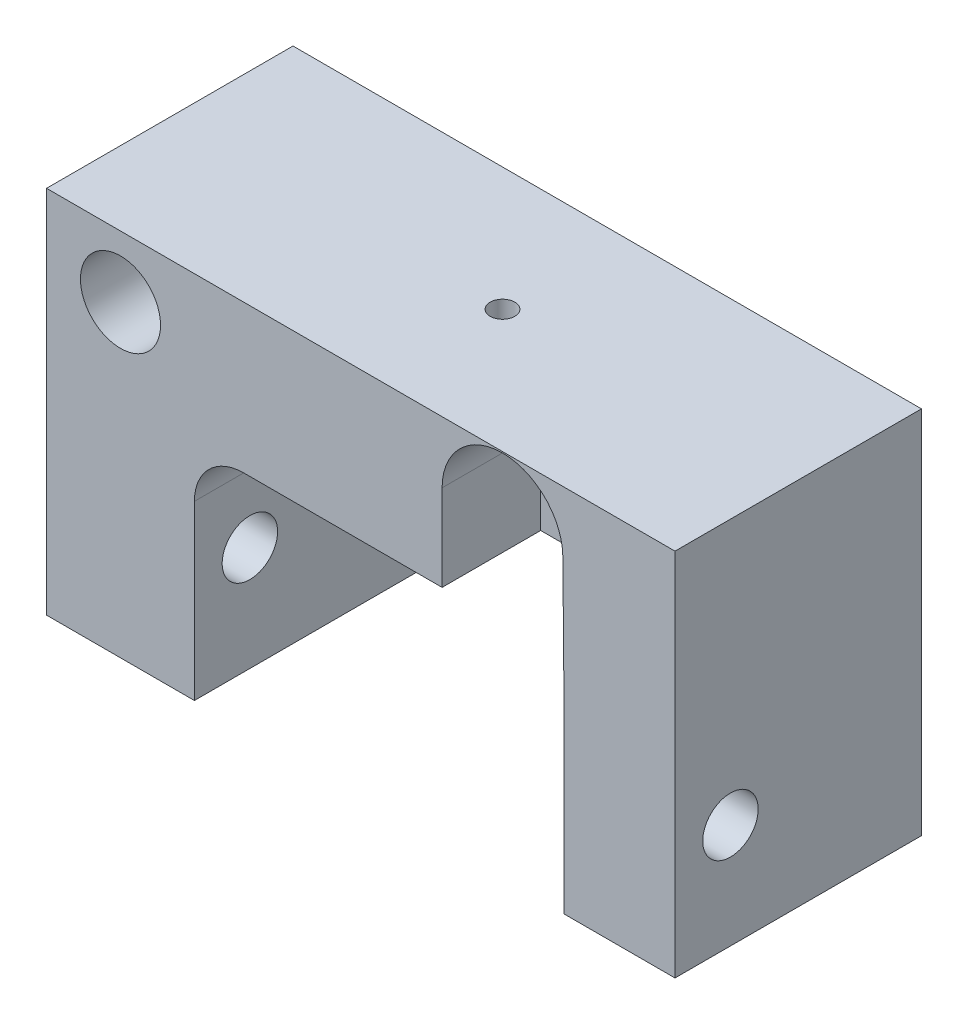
ISO-10303-21;
HEADER;
FILE_DESCRIPTION(('STEP AP214'),'2;1');
FILE_NAME('part.step','',(''),(''),'','','');
FILE_SCHEMA(('AUTOMOTIVE_DESIGN { 1 0 10303 214 1 1 1 1 }'));
ENDSEC;
DATA;
#1=APPLICATION_CONTEXT('core data for automotive mechanical design processes');
#2=APPLICATION_PROTOCOL_DEFINITION('international standard','automotive_design',2000,#1);
#3=PRODUCT_CONTEXT('',#1,'mechanical');
#4=PRODUCT('Part','Part','',(#3));
#5=PRODUCT_RELATED_PRODUCT_CATEGORY('part','',(#4));
#6=PRODUCT_DEFINITION_FORMATION('','',#4);
#7=PRODUCT_DEFINITION_CONTEXT('part definition',#1,'design');
#8=PRODUCT_DEFINITION('design','',#6,#7);
#9=PRODUCT_DEFINITION_SHAPE('','',#8);
#10=(LENGTH_UNIT() NAMED_UNIT(*) SI_UNIT(.MILLI.,.METRE.));
#11=(NAMED_UNIT(*) PLANE_ANGLE_UNIT() SI_UNIT($,.RADIAN.));
#12=(NAMED_UNIT(*) SI_UNIT($,.STERADIAN.) SOLID_ANGLE_UNIT());
#13=UNCERTAINTY_MEASURE_WITH_UNIT(LENGTH_MEASURE(1.E-05),#10,'distance_accuracy_value','');
#14=(GEOMETRIC_REPRESENTATION_CONTEXT(3) GLOBAL_UNCERTAINTY_ASSIGNED_CONTEXT((#13)) GLOBAL_UNIT_ASSIGNED_CONTEXT((#10,
#11,#12)) REPRESENTATION_CONTEXT('',''));
#15=CARTESIAN_POINT('',(0.,0.,0.));
#16=DIRECTION('',(0.,0.,1.));
#17=DIRECTION('',(1.,0.,0.));
#18=AXIS2_PLACEMENT_3D('',#15,#16,#17);
#19=CARTESIAN_POINT('',(11.5,10.,20.));
#20=DIRECTION('',(0.,0.,-1.));
#21=DIRECTION('',(-1.,0.,0.));
#22=AXIS2_PLACEMENT_3D('',#19,#20,#21);
#23=CYLINDRICAL_SURFACE('',#22,1.6);
#24=CARTESIAN_POINT('',(11.5,10.,0.));
#25=DIRECTION('',(0.,0.,-1.));
#26=DIRECTION('',(-1.,0.,0.));
#27=AXIS2_PLACEMENT_3D('',#24,#25,#26);
#28=CIRCLE('',#27,1.6);
#29=CARTESIAN_POINT('',(9.89999999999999,10.,0.));
#30=VERTEX_POINT('',#29);
#31=EDGE_CURVE('E213',#30,#30,#28,.T.);
#32=ORIENTED_EDGE('',*,*,#31,.T.);
#33=EDGE_LOOP('',(#32));
#34=FACE_BOUND('',#33,.T.);
#35=CARTESIAN_POINT('',(11.5,10.,12.));
#36=DIRECTION('',(0.,0.,1.));
#37=DIRECTION('',(1.,0.,0.));
#38=AXIS2_PLACEMENT_3D('',#35,#36,#37);
#39=CIRCLE('',#38,1.6);
#40=CARTESIAN_POINT('',(13.1,10.,12.));
#41=VERTEX_POINT('',#40);
#42=EDGE_CURVE('E38',#41,#41,#39,.F.);
#43=ORIENTED_EDGE('',*,*,#42,.F.);
#44=EDGE_LOOP('',(#43));
#45=FACE_BOUND('',#44,.T.);
#46=ADVANCED_FACE('F34',(#34,#45),#23,.F.);
#47=CARTESIAN_POINT('',(-19.5,10.,20.));
#48=DIRECTION('',(0.,0.,-1.));
#49=DIRECTION('',(-1.,0.,0.));
#50=AXIS2_PLACEMENT_3D('',#47,#48,#49);
#51=CYLINDRICAL_SURFACE('',#50,1.6);
#52=CARTESIAN_POINT('',(-19.5,10.,0.));
#53=DIRECTION('',(0.,0.,-1.));
#54=DIRECTION('',(-1.,0.,0.));
#55=AXIS2_PLACEMENT_3D('',#52,#53,#54);
#56=CIRCLE('',#55,1.6);
#57=CARTESIAN_POINT('',(-21.1,10.,0.));
#58=VERTEX_POINT('',#57);
#59=EDGE_CURVE('E210',#58,#58,#56,.T.);
#60=ORIENTED_EDGE('',*,*,#59,.T.);
#61=EDGE_LOOP('',(#60));
#62=FACE_BOUND('',#61,.T.);
#63=CARTESIAN_POINT('',(-19.5,10.,14.));
#64=DIRECTION('',(0.,0.,1.));
#65=DIRECTION('',(1.,0.,0.));
#66=AXIS2_PLACEMENT_3D('',#63,#64,#65);
#67=CIRCLE('',#66,1.6);
#68=CARTESIAN_POINT('',(-17.9,10.,14.));
#69=VERTEX_POINT('',#68);
#70=EDGE_CURVE('E193',#69,#69,#67,.F.);
#71=ORIENTED_EDGE('',*,*,#70,.F.);
#72=EDGE_LOOP('',(#71));
#73=FACE_BOUND('',#72,.T.);
#74=ADVANCED_FACE('F356',(#62,#73),#51,.F.);
#75=CARTESIAN_POINT('',(-9.50000000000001,-0.999999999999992,20.));
#76=DIRECTION('',(0.,0.,-1.));
#77=DIRECTION('',(-1.,0.,0.));
#78=AXIS2_PLACEMENT_3D('',#75,#76,#77);
#79=CYLINDRICAL_SURFACE('',#78,4.);
#80=CARTESIAN_POINT('',(-9.50000000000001,-0.999999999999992,2.2));
#81=DIRECTION('',(0.,0.,-1.));
#82=DIRECTION('',(-1.,0.,0.));
#83=AXIS2_PLACEMENT_3D('',#80,#81,#82);
#84=CIRCLE('',#83,4.);
#85=CARTESIAN_POINT('',(-13.5,-0.999999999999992,2.2));
#86=VERTEX_POINT('',#85);
#87=CARTESIAN_POINT('',(-12.4005171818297,1.75445095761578,2.2));
#88=VERTEX_POINT('',#87);
#89=EDGE_CURVE('E207',#86,#88,#84,.T.);
#90=ORIENTED_EDGE('',*,*,#89,.T.);
#91=CARTESIAN_POINT('',(-9.49999999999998,3.00000000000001,2.2));
#92=VERTEX_POINT('',#91);
#93=EDGE_CURVE('E204',#88,#92,#84,.T.);
#94=ORIENTED_EDGE('',*,*,#93,.T.);
#95=DIRECTION('',(0.,0.,-1.));
#96=VECTOR('',#95,1.);
#97=CARTESIAN_POINT('',(-9.49999999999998,3.00000000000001,20.));
#98=LINE('',#97,#96);
#99=CARTESIAN_POINT('',(-9.49999999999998,3.00000000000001,20.));
#100=VERTEX_POINT('',#99);
#101=EDGE_CURVE('E296',#100,#92,#98,.T.);
#102=ORIENTED_EDGE('',*,*,#101,.F.);
#103=CARTESIAN_POINT('',(-9.50000000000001,-0.999999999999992,20.));
#104=DIRECTION('',(0.,0.,1.));
#105=DIRECTION('',(1.,0.,0.));
#106=AXIS2_PLACEMENT_3D('',#103,#104,#105);
#107=CIRCLE('',#106,4.);
#108=CARTESIAN_POINT('',(-13.5,-1.00000000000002,20.));
#109=VERTEX_POINT('',#108);
#110=EDGE_CURVE('E256',#100,#109,#107,.T.);
#111=ORIENTED_EDGE('',*,*,#110,.T.);
#112=DIRECTION('',(0.,0.,-1.));
#113=VECTOR('',#112,1.);
#114=CARTESIAN_POINT('',(-13.5,-1.00000000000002,20.));
#115=LINE('',#114,#113);
#116=EDGE_CURVE('E293',#109,#86,#115,.T.);
#117=ORIENTED_EDGE('',*,*,#116,.T.);
#118=EDGE_LOOP('',(#90,#94,#102,#111,#117));
#119=FACE_BOUND('',#118,.T.);
#120=ADVANCED_FACE('F323',(#119),#79,.F.);
#121=CARTESIAN_POINT('',(-25.5,-15.,20.));
#122=DIRECTION('',(-1.,0.,0.));
#123=DIRECTION('',(0.,0.,1.));
#124=AXIS2_PLACEMENT_3D('',#121,#122,#123);
#125=PLANE('',#124);
#126=CARTESIAN_POINT('',(-25.5,-6.5,15.5));
#127=DIRECTION('',(1.,0.,0.));
#128=DIRECTION('',(0.,0.,-1.));
#129=AXIS2_PLACEMENT_3D('',#126,#127,#128);
#130=CIRCLE('',#129,2.25);
#131=CARTESIAN_POINT('',(-25.5,-6.5,13.25));
#132=VERTEX_POINT('',#131);
#133=EDGE_CURVE('E217',#132,#132,#130,.T.);
#134=ORIENTED_EDGE('',*,*,#133,.T.);
#135=EDGE_LOOP('',(#134));
#136=FACE_BOUND('',#135,.T.);
#137=DIRECTION('',(0.,1.,0.));
#138=VECTOR('',#137,1.);
#139=CARTESIAN_POINT('',(-25.5,-15.,0.));
#140=LINE('',#139,#138);
#141=CARTESIAN_POINT('',(-25.5,-15.,0.));
#142=VERTEX_POINT('',#141);
#143=CARTESIAN_POINT('',(-25.5,15.,0.));
#144=VERTEX_POINT('',#143);
#145=EDGE_CURVE('E234',#142,#144,#140,.T.);
#146=ORIENTED_EDGE('',*,*,#145,.F.);
#147=DIRECTION('',(0.,0.,-1.));
#148=VECTOR('',#147,1.);
#149=CARTESIAN_POINT('',(-25.5,-15.,20.));
#150=LINE('',#149,#148);
#151=CARTESIAN_POINT('',(-25.5,-15.,20.));
#152=VERTEX_POINT('',#151);
#153=EDGE_CURVE('E288',#152,#142,#150,.T.);
#154=ORIENTED_EDGE('',*,*,#153,.F.);
#155=DIRECTION('',(0.,1.,0.));
#156=VECTOR('',#155,1.);
#157=CARTESIAN_POINT('',(-25.5,-15.,20.));
#158=LINE('',#157,#156);
#159=CARTESIAN_POINT('',(-25.5,15.,20.));
#160=VERTEX_POINT('',#159);
#161=EDGE_CURVE('E235',#152,#160,#158,.T.);
#162=ORIENTED_EDGE('',*,*,#161,.T.);
#163=DIRECTION('',(0.,0.,-1.));
#164=VECTOR('',#163,1.);
#165=CARTESIAN_POINT('',(-25.5,15.,20.));
#166=LINE('',#165,#164);
#167=EDGE_CURVE('E263',#160,#144,#166,.T.);
#168=ORIENTED_EDGE('',*,*,#167,.T.);
#169=EDGE_LOOP('',(#146,#154,#162,#168));
#170=FACE_BOUND('',#169,.T.);
#171=ADVANCED_FACE('F36',(#136,#170),#125,.T.);
#172=CARTESIAN_POINT('',(-25.5,-15.,20.));
#173=DIRECTION('',(0.,1.,0.));
#174=DIRECTION('',(0.,0.,1.));
#175=AXIS2_PLACEMENT_3D('',#172,#173,#174);
#176=PLANE('',#175);
#177=DIRECTION('',(1.,0.,0.));
#178=VECTOR('',#177,1.);
#179=CARTESIAN_POINT('',(-25.5,-15.,0.));
#180=LINE('',#179,#178);
#181=CARTESIAN_POINT('',(-13.5,-15.,0.));
#182=VERTEX_POINT('',#181);
#183=EDGE_CURVE('E239',#142,#182,#180,.T.);
#184=ORIENTED_EDGE('',*,*,#183,.T.);
#185=DIRECTION('',(0.,0.,-1.));
#186=VECTOR('',#185,1.);
#187=CARTESIAN_POINT('',(-13.5,-15.,20.));
#188=LINE('',#187,#186);
#189=CARTESIAN_POINT('',(-13.5,-15.,20.));
#190=VERTEX_POINT('',#189);
#191=EDGE_CURVE('E290',#190,#182,#188,.T.);
#192=ORIENTED_EDGE('',*,*,#191,.F.);
#193=DIRECTION('',(1.,0.,0.));
#194=VECTOR('',#193,1.);
#195=CARTESIAN_POINT('',(-25.5,-15.,20.));
#196=LINE('',#195,#194);
#197=EDGE_CURVE('E261',#152,#190,#196,.T.);
#198=ORIENTED_EDGE('',*,*,#197,.F.);
#199=ORIENTED_EDGE('',*,*,#153,.T.);
#200=EDGE_LOOP('',(#184,#192,#198,#199));
#201=FACE_BOUND('',#200,.T.);
#202=ADVANCED_FACE('F382',(#201),#176,.F.);
#203=CARTESIAN_POINT('',(-13.5,-15.,20.));
#204=DIRECTION('',(-1.,0.,0.));
#205=DIRECTION('',(0.,0.,1.));
#206=AXIS2_PLACEMENT_3D('',#203,#204,#205);
#207=PLANE('',#206);
#208=CARTESIAN_POINT('',(-13.5,-6.5,15.5));
#209=DIRECTION('',(-1.,0.,0.));
#210=DIRECTION('',(0.,0.,1.));
#211=AXIS2_PLACEMENT_3D('',#208,#209,#210);
#212=CIRCLE('',#211,2.25);
#213=CARTESIAN_POINT('',(-13.5,-6.5,17.75));
#214=VERTEX_POINT('',#213);
#215=EDGE_CURVE('E225',#214,#214,#212,.T.);
#216=ORIENTED_EDGE('',*,*,#215,.T.);
#217=EDGE_LOOP('',(#216));
#218=FACE_BOUND('',#217,.T.);
#219=DIRECTION('',(0.,1.,0.));
#220=VECTOR('',#219,1.);
#221=CARTESIAN_POINT('',(-13.5,-15.,0.));
#222=LINE('',#221,#220);
#223=CARTESIAN_POINT('',(-13.5,-13.948107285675,0.));
#224=VERTEX_POINT('',#223);
#225=EDGE_CURVE('E284',#182,#224,#222,.T.);
#226=ORIENTED_EDGE('',*,*,#225,.T.);
#227=DIRECTION('',(0.,0.,-1.));
#228=VECTOR('',#227,1.);
#229=CARTESIAN_POINT('',(-13.5,-13.948107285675,2.2));
#230=LINE('',#229,#228);
#231=CARTESIAN_POINT('',(-13.5,-13.948107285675,2.2));
#232=VERTEX_POINT('',#231);
#233=EDGE_CURVE('E59',#224,#232,#230,.F.);
#234=ORIENTED_EDGE('',*,*,#233,.T.);
#235=DIRECTION('',(0.,-1.,0.));
#236=VECTOR('',#235,1.);
#237=CARTESIAN_POINT('',(-13.5,-15.,2.2));
#238=LINE('',#237,#236);
#239=EDGE_CURVE('E208',#86,#232,#238,.T.);
#240=ORIENTED_EDGE('',*,*,#239,.F.);
#241=ORIENTED_EDGE('',*,*,#116,.F.);
#242=DIRECTION('',(0.,1.,0.));
#243=VECTOR('',#242,1.);
#244=CARTESIAN_POINT('',(-13.5,-15.,20.));
#245=LINE('',#244,#243);
#246=EDGE_CURVE('E259',#190,#109,#245,.T.);
#247=ORIENTED_EDGE('',*,*,#246,.F.);
#248=ORIENTED_EDGE('',*,*,#191,.T.);
#249=EDGE_LOOP('',(#226,#234,#240,#241,#247,#248));
#250=FACE_BOUND('',#249,.T.);
#251=ADVANCED_FACE('F328',(#218,#250),#207,.F.);
#252=CARTESIAN_POINT('',(-9.49999999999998,3.00000000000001,20.));
#253=DIRECTION('',(0.,1.,0.));
#254=DIRECTION('',(0.,0.,1.));
#255=AXIS2_PLACEMENT_3D('',#252,#253,#254);
#256=PLANE('',#255);
#257=CARTESIAN_POINT('',(1.49999999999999,3.00000000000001,10.));
#258=DIRECTION('',(0.,1.,0.));
#259=DIRECTION('',(0.,0.,1.));
#260=AXIS2_PLACEMENT_3D('',#257,#258,#259);
#261=CIRCLE('',#260,1.);
#262=CARTESIAN_POINT('',(1.49999999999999,3.00000000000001,11.));
#263=VERTEX_POINT('',#262);
#264=EDGE_CURVE('E231',#263,#263,#261,.F.);
#265=ORIENTED_EDGE('',*,*,#264,.F.);
#266=EDGE_LOOP('',(#265));
#267=FACE_BOUND('',#266,.T.);
#268=DIRECTION('',(1.,0.,0.));
#269=VECTOR('',#268,1.);
#270=CARTESIAN_POINT('',(-9.49999999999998,3.00000000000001,12.));
#271=LINE('',#270,#269);
#272=CARTESIAN_POINT('',(6.59999999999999,3.00000000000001,12.));
#273=VERTEX_POINT('',#272);
#274=CARTESIAN_POINT('',(12.5,3.00000000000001,12.));
#275=VERTEX_POINT('',#274);
#276=EDGE_CURVE('E184',#273,#275,#271,.T.);
#277=ORIENTED_EDGE('',*,*,#276,.F.);
#278=DIRECTION('',(0.,0.,1.));
#279=VECTOR('',#278,1.);
#280=CARTESIAN_POINT('',(6.59999999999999,3.00000000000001,20.));
#281=LINE('',#280,#279);
#282=CARTESIAN_POINT('',(6.59999999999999,3.00000000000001,20.));
#283=VERTEX_POINT('',#282);
#284=EDGE_CURVE('E165',#273,#283,#281,.T.);
#285=ORIENTED_EDGE('',*,*,#284,.T.);
#286=DIRECTION('',(1.,0.,0.));
#287=VECTOR('',#286,1.);
#288=CARTESIAN_POINT('',(-9.49999999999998,3.00000000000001,20.));
#289=LINE('',#288,#287);
#290=EDGE_CURVE('E253',#100,#283,#289,.T.);
#291=ORIENTED_EDGE('',*,*,#290,.F.);
#292=ORIENTED_EDGE('',*,*,#101,.T.);
#293=DIRECTION('',(-1.,0.,0.));
#294=VECTOR('',#293,1.);
#295=CARTESIAN_POINT('',(-9.49999999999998,3.00000000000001,2.2));
#296=LINE('',#295,#294);
#297=CARTESIAN_POINT('',(4.16384461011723,3.00000000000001,2.2));
#298=VERTEX_POINT('',#297);
#299=EDGE_CURVE('E11',#298,#92,#296,.T.);
#300=ORIENTED_EDGE('',*,*,#299,.F.);
#301=DIRECTION('',(0.,0.,-1.));
#302=VECTOR('',#301,1.);
#303=CARTESIAN_POINT('',(4.16384461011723,3.00000000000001,2.2));
#304=LINE('',#303,#302);
#305=CARTESIAN_POINT('',(4.16384461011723,3.00000000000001,0.));
#306=VERTEX_POINT('',#305);
#307=EDGE_CURVE('E199',#298,#306,#304,.T.);
#308=ORIENTED_EDGE('',*,*,#307,.T.);
#309=DIRECTION('',(1.,0.,0.));
#310=VECTOR('',#309,1.);
#311=CARTESIAN_POINT('',(-9.49999999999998,3.00000000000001,0.));
#312=LINE('',#311,#310);
#313=CARTESIAN_POINT('',(12.5,3.00000000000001,0.));
#314=VERTEX_POINT('',#313);
#315=EDGE_CURVE('E281',#306,#314,#312,.T.);
#316=ORIENTED_EDGE('',*,*,#315,.T.);
#317=DIRECTION('',(0.,0.,-1.));
#318=VECTOR('',#317,1.);
#319=CARTESIAN_POINT('',(12.5,3.00000000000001,20.));
#320=LINE('',#319,#318);
#321=EDGE_CURVE('E299',#275,#314,#320,.T.);
#322=ORIENTED_EDGE('',*,*,#321,.F.);
#323=EDGE_LOOP('',(#277,#285,#291,#292,#300,#308,#316,#322));
#324=FACE_BOUND('',#323,.T.);
#325=ADVANCED_FACE('F337',(#267,#324),#256,.F.);
#326=CARTESIAN_POINT('',(12.5,-0.999999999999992,20.));
#327=DIRECTION('',(0.,0.,-1.));
#328=DIRECTION('',(-1.,0.,0.));
#329=AXIS2_PLACEMENT_3D('',#326,#327,#328);
#330=CYLINDRICAL_SURFACE('',#329,4.);
#331=DIRECTION('',(0.,0.,-1.));
#332=VECTOR('',#331,1.);
#333=CARTESIAN_POINT('',(16.499341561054,-0.927425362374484,20.));
#334=LINE('',#333,#332);
#335=CARTESIAN_POINT('',(16.499341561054,-0.927425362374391,12.));
#336=VERTEX_POINT('',#335);
#337=CARTESIAN_POINT('',(16.4993415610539,-0.927425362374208,20.));
#338=VERTEX_POINT('',#337);
#339=EDGE_CURVE('E187',#336,#338,#334,.F.);
#340=ORIENTED_EDGE('',*,*,#339,.F.);
#341=CARTESIAN_POINT('',(12.5,-0.999999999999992,12.));
#342=DIRECTION('',(0.,0.,1.));
#343=DIRECTION('',(1.,0.,0.));
#344=AXIS2_PLACEMENT_3D('',#341,#342,#343);
#345=CIRCLE('',#344,4.);
#346=EDGE_CURVE('E181',#336,#275,#345,.T.);
#347=ORIENTED_EDGE('',*,*,#346,.T.);
#348=ORIENTED_EDGE('',*,*,#321,.T.);
#349=CARTESIAN_POINT('',(12.5,-0.999999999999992,0.));
#350=DIRECTION('',(0.,0.,1.));
#351=DIRECTION('',(1.,0.,0.));
#352=AXIS2_PLACEMENT_3D('',#349,#350,#351);
#353=CIRCLE('',#352,4.);
#354=CARTESIAN_POINT('',(16.5,-1.00000000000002,0.));
#355=VERTEX_POINT('',#354);
#356=EDGE_CURVE('E278',#355,#314,#353,.T.);
#357=ORIENTED_EDGE('',*,*,#356,.F.);
#358=DIRECTION('',(0.,0.,-1.));
#359=VECTOR('',#358,1.);
#360=CARTESIAN_POINT('',(16.5,-1.00000000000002,20.));
#361=LINE('',#360,#359);
#362=CARTESIAN_POINT('',(16.5,-1.00000000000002,20.));
#363=VERTEX_POINT('',#362);
#364=EDGE_CURVE('E301',#363,#355,#361,.T.);
#365=ORIENTED_EDGE('',*,*,#364,.F.);
#366=CARTESIAN_POINT('',(12.5,-0.999999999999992,20.));
#367=DIRECTION('',(0.,0.,1.));
#368=DIRECTION('',(1.,0.,0.));
#369=AXIS2_PLACEMENT_3D('',#366,#367,#368);
#370=CIRCLE('',#369,4.);
#371=EDGE_CURVE('E250',#363,#338,#370,.T.);
#372=ORIENTED_EDGE('',*,*,#371,.T.);
#373=EDGE_LOOP('',(#340,#347,#348,#357,#365,#372));
#374=FACE_BOUND('',#373,.T.);
#375=ADVANCED_FACE('F393',(#374),#330,.F.);
#376=CARTESIAN_POINT('',(16.5,-15.,20.));
#377=DIRECTION('',(-1.,0.,0.));
#378=DIRECTION('',(0.,0.,1.));
#379=AXIS2_PLACEMENT_3D('',#376,#377,#378);
#380=PLANE('',#379);
#381=CARTESIAN_POINT('',(16.5,-6.5,15.5));
#382=DIRECTION('',(-1.,0.,0.));
#383=DIRECTION('',(0.,0.,1.));
#384=AXIS2_PLACEMENT_3D('',#381,#382,#383);
#385=CIRCLE('',#384,2.25);
#386=CARTESIAN_POINT('',(16.5,-6.5,17.75));
#387=VERTEX_POINT('',#386);
#388=EDGE_CURVE('E220',#387,#387,#385,.T.);
#389=ORIENTED_EDGE('',*,*,#388,.F.);
#390=EDGE_LOOP('',(#389));
#391=FACE_BOUND('',#390,.T.);
#392=DIRECTION('',(0.,1.,0.));
#393=VECTOR('',#392,1.);
#394=CARTESIAN_POINT('',(16.5,-15.,0.));
#395=LINE('',#394,#393);
#396=CARTESIAN_POINT('',(16.5,-15.,0.));
#397=VERTEX_POINT('',#396);
#398=EDGE_CURVE('E275',#397,#355,#395,.T.);
#399=ORIENTED_EDGE('',*,*,#398,.F.);
#400=DIRECTION('',(0.,0.,-1.));
#401=VECTOR('',#400,1.);
#402=CARTESIAN_POINT('',(16.5,-15.,20.));
#403=LINE('',#402,#401);
#404=CARTESIAN_POINT('',(16.5,-15.,20.));
#405=VERTEX_POINT('',#404);
#406=EDGE_CURVE('E303',#405,#397,#403,.T.);
#407=ORIENTED_EDGE('',*,*,#406,.F.);
#408=DIRECTION('',(0.,1.,0.));
#409=VECTOR('',#408,1.);
#410=CARTESIAN_POINT('',(16.5,-15.,20.));
#411=LINE('',#410,#409);
#412=EDGE_CURVE('E247',#405,#363,#411,.T.);
#413=ORIENTED_EDGE('',*,*,#412,.T.);
#414=ORIENTED_EDGE('',*,*,#364,.T.);
#415=EDGE_LOOP('',(#399,#407,#413,#414));
#416=FACE_BOUND('',#415,.T.);
#417=ADVANCED_FACE('F397',(#391,#416),#380,.T.);
#418=CARTESIAN_POINT('',(25.5,-15.,20.));
#419=DIRECTION('',(0.,-1.,0.));
#420=DIRECTION('',(1.,0.,0.));
#421=AXIS2_PLACEMENT_3D('',#418,#419,#420);
#422=PLANE('',#421);
#423=DIRECTION('',(-1.,0.,0.));
#424=VECTOR('',#423,1.);
#425=CARTESIAN_POINT('',(25.5,-15.,0.));
#426=LINE('',#425,#424);
#427=CARTESIAN_POINT('',(25.5,-15.,0.));
#428=VERTEX_POINT('',#427);
#429=EDGE_CURVE('E272',#428,#397,#426,.T.);
#430=ORIENTED_EDGE('',*,*,#429,.F.);
#431=DIRECTION('',(0.,0.,-1.));
#432=VECTOR('',#431,1.);
#433=CARTESIAN_POINT('',(25.5,-15.,20.));
#434=LINE('',#433,#432);
#435=CARTESIAN_POINT('',(25.5,-15.,20.));
#436=VERTEX_POINT('',#435);
#437=EDGE_CURVE('E305',#436,#428,#434,.T.);
#438=ORIENTED_EDGE('',*,*,#437,.F.);
#439=DIRECTION('',(-1.,0.,0.));
#440=VECTOR('',#439,1.);
#441=CARTESIAN_POINT('',(25.5,-15.,20.));
#442=LINE('',#441,#440);
#443=EDGE_CURVE('E244',#436,#405,#442,.T.);
#444=ORIENTED_EDGE('',*,*,#443,.T.);
#445=ORIENTED_EDGE('',*,*,#406,.T.);
#446=EDGE_LOOP('',(#430,#438,#444,#445));
#447=FACE_BOUND('',#446,.T.);
#448=ADVANCED_FACE('F401',(#447),#422,.T.);
#449=CARTESIAN_POINT('',(25.5,-15.,20.));
#450=DIRECTION('',(-1.,0.,0.));
#451=DIRECTION('',(0.,0.,1.));
#452=AXIS2_PLACEMENT_3D('',#449,#450,#451);
#453=PLANE('',#452);
#454=CARTESIAN_POINT('',(25.5,-6.5,15.5));
#455=DIRECTION('',(1.,0.,0.));
#456=DIRECTION('',(0.,0.,-1.));
#457=AXIS2_PLACEMENT_3D('',#454,#455,#456);
#458=CIRCLE('',#457,2.25);
#459=CARTESIAN_POINT('',(25.5,-6.5,13.25));
#460=VERTEX_POINT('',#459);
#461=EDGE_CURVE('E216',#460,#460,#458,.T.);
#462=ORIENTED_EDGE('',*,*,#461,.F.);
#463=EDGE_LOOP('',(#462));
#464=FACE_BOUND('',#463,.T.);
#465=DIRECTION('',(0.,1.,0.));
#466=VECTOR('',#465,1.);
#467=CARTESIAN_POINT('',(25.5,-15.,0.));
#468=LINE('',#467,#466);
#469=CARTESIAN_POINT('',(25.5,15.,0.));
#470=VERTEX_POINT('',#469);
#471=EDGE_CURVE('E269',#428,#470,#468,.T.);
#472=ORIENTED_EDGE('',*,*,#471,.T.);
#473=DIRECTION('',(0.,0.,-1.));
#474=VECTOR('',#473,1.);
#475=CARTESIAN_POINT('',(25.5,15.,20.));
#476=LINE('',#475,#474);
#477=CARTESIAN_POINT('',(25.5,15.,20.));
#478=VERTEX_POINT('',#477);
#479=EDGE_CURVE('E307',#478,#470,#476,.T.);
#480=ORIENTED_EDGE('',*,*,#479,.F.);
#481=DIRECTION('',(0.,1.,0.));
#482=VECTOR('',#481,1.);
#483=CARTESIAN_POINT('',(25.5,-15.,20.));
#484=LINE('',#483,#482);
#485=EDGE_CURVE('E242',#436,#478,#484,.T.);
#486=ORIENTED_EDGE('',*,*,#485,.F.);
#487=ORIENTED_EDGE('',*,*,#437,.T.);
#488=EDGE_LOOP('',(#472,#480,#486,#487));
#489=FACE_BOUND('',#488,.T.);
#490=ADVANCED_FACE('F405',(#464,#489),#453,.F.);
#491=CARTESIAN_POINT('',(-25.5,15.,20.));
#492=DIRECTION('',(0.,1.,0.));
#493=DIRECTION('',(0.,0.,1.));
#494=AXIS2_PLACEMENT_3D('',#491,#492,#493);
#495=PLANE('',#494);
#496=CARTESIAN_POINT('',(1.49999999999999,15.,10.));
#497=DIRECTION('',(0.,1.,0.));
#498=DIRECTION('',(0.,0.,1.));
#499=AXIS2_PLACEMENT_3D('',#496,#497,#498);
#500=CIRCLE('',#499,1.);
#501=CARTESIAN_POINT('',(1.49999999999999,15.,11.));
#502=VERTEX_POINT('',#501);
#503=EDGE_CURVE('E228',#502,#502,#500,.T.);
#504=ORIENTED_EDGE('',*,*,#503,.F.);
#505=EDGE_LOOP('',(#504));
#506=FACE_BOUND('',#505,.T.);
#507=DIRECTION('',(1.,0.,0.));
#508=VECTOR('',#507,1.);
#509=CARTESIAN_POINT('',(-25.5,15.,0.));
#510=LINE('',#509,#508);
#511=EDGE_CURVE('E266',#144,#470,#510,.T.);
#512=ORIENTED_EDGE('',*,*,#511,.F.);
#513=ORIENTED_EDGE('',*,*,#167,.F.);
#514=DIRECTION('',(1.,0.,0.));
#515=VECTOR('',#514,1.);
#516=CARTESIAN_POINT('',(-25.5,15.,20.));
#517=LINE('',#516,#515);
#518=EDGE_CURVE('E238',#160,#478,#517,.T.);
#519=ORIENTED_EDGE('',*,*,#518,.T.);
#520=ORIENTED_EDGE('',*,*,#479,.T.);
#521=EDGE_LOOP('',(#512,#513,#519,#520));
#522=FACE_BOUND('',#521,.T.);
#523=ADVANCED_FACE('F377',(#506,#522),#495,.T.);
#524=CARTESIAN_POINT('',(12.5,-0.999999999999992,20.));
#525=DIRECTION('',(0.,0.,1.));
#526=DIRECTION('',(1.,0.,0.));
#527=AXIS2_PLACEMENT_3D('',#524,#525,#526);
#528=PLANE('',#527);
#529=DIRECTION('',(-0.00907220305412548,0.999958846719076,0.));
#530=VECTOR('',#529,1.);
#531=CARTESIAN_POINT('',(16.3997983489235,10.0444537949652,20.));
#532=LINE('',#531,#530);
#533=CARTESIAN_POINT('',(16.3997983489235,10.0444537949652,20.));
#534=VERTEX_POINT('',#533);
#535=EDGE_CURVE('E172',#338,#534,#532,.T.);
#536=ORIENTED_EDGE('',*,*,#535,.F.);
#537=ORIENTED_EDGE('',*,*,#371,.F.);
#538=ORIENTED_EDGE('',*,*,#412,.F.);
#539=ORIENTED_EDGE('',*,*,#443,.F.);
#540=ORIENTED_EDGE('',*,*,#485,.T.);
#541=ORIENTED_EDGE('',*,*,#518,.F.);
#542=ORIENTED_EDGE('',*,*,#161,.F.);
#543=ORIENTED_EDGE('',*,*,#197,.T.);
#544=ORIENTED_EDGE('',*,*,#246,.T.);
#545=ORIENTED_EDGE('',*,*,#110,.F.);
#546=ORIENTED_EDGE('',*,*,#290,.T.);
#547=DIRECTION('',(0.,-1.,0.));
#548=VECTOR('',#547,1.);
#549=CARTESIAN_POINT('',(6.59999999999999,-1.00000000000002,20.));
#550=LINE('',#549,#548);
#551=CARTESIAN_POINT('',(6.59999999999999,10.,20.));
#552=VERTEX_POINT('',#551);
#553=EDGE_CURVE('E174',#552,#283,#550,.T.);
#554=ORIENTED_EDGE('',*,*,#553,.F.);
#555=CARTESIAN_POINT('',(11.5,10.,20.));
#556=DIRECTION('',(0.,0.,1.));
#557=DIRECTION('',(1.,0.,0.));
#558=AXIS2_PLACEMENT_3D('',#555,#556,#557);
#559=CIRCLE('',#558,4.9);
#560=EDGE_CURVE('E51',#534,#552,#559,.T.);
#561=ORIENTED_EDGE('',*,*,#560,.F.);
#562=EDGE_LOOP('',(#536,#537,#538,#539,#540,#541,#542,#543,#544,#545,#546,#554,#561));
#563=FACE_BOUND('',#562,.T.);
#564=CARTESIAN_POINT('',(-19.5,10.,20.));
#565=DIRECTION('',(0.,0.,1.));
#566=DIRECTION('',(1.,0.,0.));
#567=AXIS2_PLACEMENT_3D('',#564,#565,#566);
#568=CIRCLE('',#567,3.25);
#569=CARTESIAN_POINT('',(-16.25,10.,20.));
#570=VERTEX_POINT('',#569);
#571=EDGE_CURVE('E189',#570,#570,#568,.T.);
#572=ORIENTED_EDGE('',*,*,#571,.F.);
#573=EDGE_LOOP('',(#572));
#574=FACE_BOUND('',#573,.T.);
#575=ADVANCED_FACE('F374',(#563,#574),#528,.T.);
#576=CARTESIAN_POINT('',(12.5,-0.999999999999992,0.));
#577=DIRECTION('',(0.,0.,1.));
#578=DIRECTION('',(1.,0.,0.));
#579=AXIS2_PLACEMENT_3D('',#576,#577,#578);
#580=PLANE('',#579);
#581=ORIENTED_EDGE('',*,*,#59,.F.);
#582=EDGE_LOOP('',(#581));
#583=FACE_BOUND('',#582,.T.);
#584=ORIENTED_EDGE('',*,*,#31,.F.);
#585=EDGE_LOOP('',(#584));
#586=FACE_BOUND('',#585,.T.);
#587=ORIENTED_EDGE('',*,*,#315,.F.);
#588=CARTESIAN_POINT('',(-3.43101450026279,-6.763359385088,0.));
#589=DIRECTION('',(0.,0.,1.));
#590=DIRECTION('',(1.,0.,0.));
#591=AXIS2_PLACEMENT_3D('',#588,#589,#590);
#592=CIRCLE('',#591,12.3695218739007);
#593=EDGE_CURVE('E43',#306,#224,#592,.T.);
#594=ORIENTED_EDGE('',*,*,#593,.T.);
#595=ORIENTED_EDGE('',*,*,#225,.F.);
#596=ORIENTED_EDGE('',*,*,#183,.F.);
#597=ORIENTED_EDGE('',*,*,#145,.T.);
#598=ORIENTED_EDGE('',*,*,#511,.T.);
#599=ORIENTED_EDGE('',*,*,#471,.F.);
#600=ORIENTED_EDGE('',*,*,#429,.T.);
#601=ORIENTED_EDGE('',*,*,#398,.T.);
#602=ORIENTED_EDGE('',*,*,#356,.T.);
#603=EDGE_LOOP('',(#587,#594,#595,#596,#597,#598,#599,#600,#601,#602));
#604=FACE_BOUND('',#603,.T.);
#605=ADVANCED_FACE('F334',(#583,#586,#604),#580,.F.);
#606=CARTESIAN_POINT('',(1.49999999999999,-15.001,10.));
#607=DIRECTION('',(0.,1.,0.));
#608=DIRECTION('',(0.,0.,1.));
#609=AXIS2_PLACEMENT_3D('',#606,#607,#608);
#610=CYLINDRICAL_SURFACE('',#609,1.);
#611=ORIENTED_EDGE('',*,*,#503,.T.);
#612=EDGE_LOOP('',(#611));
#613=FACE_BOUND('',#612,.T.);
#614=ORIENTED_EDGE('',*,*,#264,.T.);
#615=EDGE_LOOP('',(#614));
#616=FACE_BOUND('',#615,.T.);
#617=ADVANCED_FACE('F369',(#613,#616),#610,.F.);
#618=CARTESIAN_POINT('',(-25.5,-6.5,15.5));
#619=DIRECTION('',(1.,0.,0.));
#620=DIRECTION('',(0.,0.,-1.));
#621=AXIS2_PLACEMENT_3D('',#618,#619,#620);
#622=CYLINDRICAL_SURFACE('',#621,2.25);
#623=ORIENTED_EDGE('',*,*,#388,.T.);
#624=EDGE_LOOP('',(#623));
#625=FACE_BOUND('',#624,.T.);
#626=ORIENTED_EDGE('',*,*,#461,.T.);
#627=EDGE_LOOP('',(#626));
#628=FACE_BOUND('',#627,.T.);
#629=ADVANCED_FACE('F366',(#625,#628),#622,.F.);
#630=ORIENTED_EDGE('',*,*,#133,.F.);
#631=EDGE_LOOP('',(#630));
#632=FACE_BOUND('',#631,.T.);
#633=ORIENTED_EDGE('',*,*,#215,.F.);
#634=EDGE_LOOP('',(#633));
#635=FACE_BOUND('',#634,.T.);
#636=ADVANCED_FACE('F354',(#632,#635),#622,.F.);
#637=CARTESIAN_POINT('',(-3.43101450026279,-6.763359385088,2.2));
#638=DIRECTION('',(0.,0.,-1.));
#639=DIRECTION('',(-1.,0.,0.));
#640=AXIS2_PLACEMENT_3D('',#637,#638,#639);
#641=PLANE('',#640);
#642=ORIENTED_EDGE('',*,*,#239,.T.);
#643=CARTESIAN_POINT('',(-3.43101450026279,-6.763359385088,2.2));
#644=DIRECTION('',(0.,0.,-1.));
#645=DIRECTION('',(-1.,0.,0.));
#646=AXIS2_PLACEMENT_3D('',#643,#644,#645);
#647=CIRCLE('',#646,12.3695218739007);
#648=EDGE_CURVE('E200',#232,#88,#647,.T.);
#649=ORIENTED_EDGE('',*,*,#648,.T.);
#650=ORIENTED_EDGE('',*,*,#89,.F.);
#651=EDGE_LOOP('',(#642,#649,#650));
#652=FACE_BOUND('',#651,.T.);
#653=ADVANCED_FACE('F316',(#652),#641,.T.);
#654=CARTESIAN_POINT('',(-3.43101450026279,-6.763359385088,2.2));
#655=DIRECTION('',(0.,0.,-1.));
#656=DIRECTION('',(-1.,0.,0.));
#657=AXIS2_PLACEMENT_3D('',#654,#655,#656);
#658=CYLINDRICAL_SURFACE('',#657,12.3695218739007);
#659=ORIENTED_EDGE('',*,*,#593,.F.);
#660=ORIENTED_EDGE('',*,*,#307,.F.);
#661=EDGE_CURVE('E196',#88,#298,#647,.T.);
#662=ORIENTED_EDGE('',*,*,#661,.F.);
#663=ORIENTED_EDGE('',*,*,#648,.F.);
#664=ORIENTED_EDGE('',*,*,#233,.F.);
#665=EDGE_LOOP('',(#659,#660,#662,#663,#664));
#666=FACE_BOUND('',#665,.T.);
#667=ADVANCED_FACE('F319',(#666),#658,.F.);
#668=ORIENTED_EDGE('',*,*,#661,.T.);
#669=ORIENTED_EDGE('',*,*,#299,.T.);
#670=ORIENTED_EDGE('',*,*,#93,.F.);
#671=EDGE_LOOP('',(#668,#669,#670));
#672=FACE_BOUND('',#671,.T.);
#673=ADVANCED_FACE('F340',(#672),#641,.T.);
#674=CARTESIAN_POINT('',(-19.5,10.,14.));
#675=DIRECTION('',(0.,0.,1.));
#676=DIRECTION('',(1.,0.,0.));
#677=AXIS2_PLACEMENT_3D('',#674,#675,#676);
#678=PLANE('',#677);
#679=CARTESIAN_POINT('',(-19.5,10.,14.));
#680=DIRECTION('',(0.,0.,1.));
#681=DIRECTION('',(1.,0.,0.));
#682=AXIS2_PLACEMENT_3D('',#679,#680,#681);
#683=CIRCLE('',#682,3.25);
#684=CARTESIAN_POINT('',(-16.25,10.,14.));
#685=VERTEX_POINT('',#684);
#686=EDGE_CURVE('E190',#685,#685,#683,.T.);
#687=ORIENTED_EDGE('',*,*,#686,.T.);
#688=EDGE_LOOP('',(#687));
#689=FACE_BOUND('',#688,.T.);
#690=ORIENTED_EDGE('',*,*,#70,.T.);
#691=EDGE_LOOP('',(#690));
#692=FACE_BOUND('',#691,.T.);
#693=ADVANCED_FACE('F342',(#689,#692),#678,.T.);
#694=CARTESIAN_POINT('',(-19.5,10.,14.));
#695=DIRECTION('',(0.,0.,1.));
#696=DIRECTION('',(1.,0.,0.));
#697=AXIS2_PLACEMENT_3D('',#694,#695,#696);
#698=CYLINDRICAL_SURFACE('',#697,3.25);
#699=ORIENTED_EDGE('',*,*,#686,.F.);
#700=EDGE_LOOP('',(#699));
#701=FACE_BOUND('',#700,.T.);
#702=ORIENTED_EDGE('',*,*,#571,.T.);
#703=EDGE_LOOP('',(#702));
#704=FACE_BOUND('',#703,.T.);
#705=ADVANCED_FACE('F348',(#701,#704),#698,.F.);
#706=CARTESIAN_POINT('',(6.59999999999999,-1.00000000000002,12.));
#707=DIRECTION('',(-1.,0.,0.));
#708=DIRECTION('',(0.,-1.,0.));
#709=AXIS2_PLACEMENT_3D('',#706,#707,#708);
#710=PLANE('',#709);
#711=DIRECTION('',(0.,-1.,0.));
#712=VECTOR('',#711,1.);
#713=CARTESIAN_POINT('',(6.59999999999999,-1.00000000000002,12.));
#714=LINE('',#713,#712);
#715=CARTESIAN_POINT('',(6.59999999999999,10.,12.));
#716=VERTEX_POINT('',#715);
#717=EDGE_CURVE('E162',#716,#273,#714,.T.);
#718=ORIENTED_EDGE('',*,*,#717,.F.);
#719=DIRECTION('',(0.,0.,1.));
#720=VECTOR('',#719,1.);
#721=CARTESIAN_POINT('',(6.59999999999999,10.,12.));
#722=LINE('',#721,#720);
#723=EDGE_CURVE('E151',#716,#552,#722,.T.);
#724=ORIENTED_EDGE('',*,*,#723,.T.);
#725=ORIENTED_EDGE('',*,*,#553,.T.);
#726=ORIENTED_EDGE('',*,*,#284,.F.);
#727=EDGE_LOOP('',(#718,#724,#725,#726));
#728=FACE_BOUND('',#727,.T.);
#729=ADVANCED_FACE('F163',(#728),#710,.F.);
#730=CARTESIAN_POINT('',(11.5,10.,12.));
#731=DIRECTION('',(0.,0.,1.));
#732=DIRECTION('',(1.,0.,0.));
#733=AXIS2_PLACEMENT_3D('',#730,#731,#732);
#734=PLANE('',#733);
#735=ORIENTED_EDGE('',*,*,#42,.T.);
#736=EDGE_LOOP('',(#735));
#737=FACE_BOUND('',#736,.T.);
#738=ORIENTED_EDGE('',*,*,#276,.T.);
#739=ORIENTED_EDGE('',*,*,#346,.F.);
#740=DIRECTION('',(-0.00907220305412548,0.999958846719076,0.));
#741=VECTOR('',#740,1.);
#742=CARTESIAN_POINT('',(16.3997983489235,10.0444537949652,12.));
#743=LINE('',#742,#741);
#744=CARTESIAN_POINT('',(16.3997983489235,10.0444537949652,12.));
#745=VERTEX_POINT('',#744);
#746=EDGE_CURVE('E159',#336,#745,#743,.T.);
#747=ORIENTED_EDGE('',*,*,#746,.T.);
#748=CARTESIAN_POINT('',(11.5,10.,12.));
#749=DIRECTION('',(0.,0.,1.));
#750=DIRECTION('',(1.,0.,0.));
#751=AXIS2_PLACEMENT_3D('',#748,#749,#750);
#752=CIRCLE('',#751,4.9);
#753=EDGE_CURVE('E155',#745,#716,#752,.T.);
#754=ORIENTED_EDGE('',*,*,#753,.T.);
#755=ORIENTED_EDGE('',*,*,#717,.T.);
#756=EDGE_LOOP('',(#738,#739,#747,#754,#755));
#757=FACE_BOUND('',#756,.T.);
#758=ADVANCED_FACE('F169',(#737,#757),#734,.T.);
#759=CARTESIAN_POINT('',(11.5,10.,12.));
#760=DIRECTION('',(0.,0.,1.));
#761=DIRECTION('',(1.,0.,0.));
#762=AXIS2_PLACEMENT_3D('',#759,#760,#761);
#763=CYLINDRICAL_SURFACE('',#762,4.9);
#764=ORIENTED_EDGE('',*,*,#560,.T.);
#765=ORIENTED_EDGE('',*,*,#723,.F.);
#766=ORIENTED_EDGE('',*,*,#753,.F.);
#767=DIRECTION('',(0.,0.,1.));
#768=VECTOR('',#767,1.);
#769=CARTESIAN_POINT('',(16.3997983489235,10.0444537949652,12.));
#770=LINE('',#769,#768);
#771=EDGE_CURVE('E158',#745,#534,#770,.T.);
#772=ORIENTED_EDGE('',*,*,#771,.T.);
#773=EDGE_LOOP('',(#764,#765,#766,#772));
#774=FACE_BOUND('',#773,.T.);
#775=ADVANCED_FACE('F153',(#774),#763,.F.);
#776=CARTESIAN_POINT('',(16.3997983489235,10.0444537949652,12.));
#777=DIRECTION('',(0.999958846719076,0.00907220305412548,0.));
#778=DIRECTION('',(-0.00907220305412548,0.999958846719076,0.));
#779=AXIS2_PLACEMENT_3D('',#776,#777,#778);
#780=PLANE('',#779);
#781=ORIENTED_EDGE('',*,*,#339,.T.);
#782=ORIENTED_EDGE('',*,*,#535,.T.);
#783=ORIENTED_EDGE('',*,*,#771,.F.);
#784=ORIENTED_EDGE('',*,*,#746,.F.);
#785=EDGE_LOOP('',(#781,#782,#783,#784));
#786=FACE_BOUND('',#785,.T.);
#787=ADVANCED_FACE('F435',(#786),#780,.F.);
#788=CLOSED_SHELL('',(#46,#74,#120,#171,#202,#251,#325,#375,#417,#448,#490,#523,#575,#605,#617,
#629,#636,#653,#667,#673,#693,#705,#729,#758,#775,#787));
#789=MANIFOLD_SOLID_BREP('B2',#788);
#790=ADVANCED_BREP_SHAPE_REPRESENTATION('',(#18,#789),#14);
#791=SHAPE_DEFINITION_REPRESENTATION(#9,#790);
ENDSEC;
END-ISO-10303-21;
